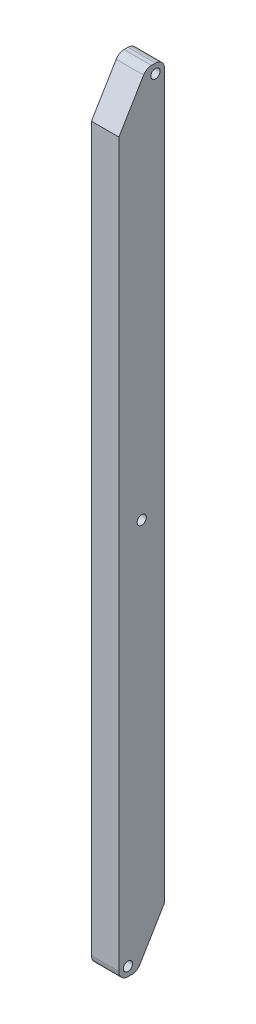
ISO-10303-21;
HEADER;
FILE_DESCRIPTION(('STEP AP214'),'2;1');
FILE_NAME('part.step','',(''),(''),'','','');
FILE_SCHEMA(('AUTOMOTIVE_DESIGN { 1 0 10303 214 1 1 1 1 }'));
ENDSEC;
DATA;
#1=APPLICATION_CONTEXT('core data for automotive mechanical design processes');
#2=APPLICATION_PROTOCOL_DEFINITION('international standard','automotive_design',2000,#1);
#3=PRODUCT_CONTEXT('',#1,'mechanical');
#4=PRODUCT('Part','Part','',(#3));
#5=PRODUCT_RELATED_PRODUCT_CATEGORY('part','',(#4));
#6=PRODUCT_DEFINITION_FORMATION('','',#4);
#7=PRODUCT_DEFINITION_CONTEXT('part definition',#1,'design');
#8=PRODUCT_DEFINITION('design','',#6,#7);
#9=PRODUCT_DEFINITION_SHAPE('','',#8);
#10=(LENGTH_UNIT() NAMED_UNIT(*) SI_UNIT(.MILLI.,.METRE.));
#11=(NAMED_UNIT(*) PLANE_ANGLE_UNIT() SI_UNIT($,.RADIAN.));
#12=(NAMED_UNIT(*) SI_UNIT($,.STERADIAN.) SOLID_ANGLE_UNIT());
#13=UNCERTAINTY_MEASURE_WITH_UNIT(LENGTH_MEASURE(1.E-05),#10,'distance_accuracy_value','');
#14=(GEOMETRIC_REPRESENTATION_CONTEXT(3) GLOBAL_UNCERTAINTY_ASSIGNED_CONTEXT((#13)) GLOBAL_UNIT_ASSIGNED_CONTEXT((#10,
#11,#12)) REPRESENTATION_CONTEXT('',''));
#15=CARTESIAN_POINT('',(0.,0.,0.));
#16=DIRECTION('',(0.,0.,1.));
#17=DIRECTION('',(1.,0.,0.));
#18=AXIS2_PLACEMENT_3D('',#15,#16,#17);
#19=CARTESIAN_POINT('',(620.,0.,50.));
#20=DIRECTION('',(1.,0.,0.));
#21=DIRECTION('',(0.,0.,-1.));
#22=AXIS2_PLACEMENT_3D('',#19,#20,#21);
#23=PLANE('',#22);
#24=CARTESIAN_POINT('',(620.,0.,0.));
#25=DIRECTION('',(1.,0.,0.));
#26=DIRECTION('',(0.,0.,-1.));
#27=AXIS2_PLACEMENT_3D('',#24,#25,#26);
#28=CIRCLE('',#27,10.);
#29=CARTESIAN_POINT('',(620.,0.,-10.));
#30=VERTEX_POINT('',#29);
#31=EDGE_CURVE('E180',#30,#30,#28,.T.);
#32=ORIENTED_EDGE('',*,*,#31,.F.);
#33=EDGE_LOOP('',(#32));
#34=FACE_BOUND('',#33,.T.);
#35=DIRECTION('',(0.,0.,1.));
#36=VECTOR('',#35,1.);
#37=CARTESIAN_POINT('',(620.,850.,-9.99999999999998));
#38=LINE('',#37,#36);
#39=CARTESIAN_POINT('',(620.,850.,-30.));
#40=VERTEX_POINT('',#39);
#41=CARTESIAN_POINT('',(620.,850.,-21.3238075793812));
#42=VERTEX_POINT('',#41);
#43=EDGE_CURVE('E147',#40,#42,#38,.T.);
#44=ORIENTED_EDGE('',*,*,#43,.T.);
#45=CARTESIAN_POINT('',(620.,830.,-21.3238075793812));
#46=DIRECTION('',(1.,0.,0.));
#47=DIRECTION('',(0.,0.,-1.));
#48=AXIS2_PLACEMENT_3D('',#45,#46,#47);
#49=CIRCLE('',#48,20.);
#50=CARTESIAN_POINT('',(620.,840.28991510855,-4.17394906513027));
#51=VERTEX_POINT('',#50);
#52=EDGE_CURVE('E170',#42,#51,#49,.T.);
#53=ORIENTED_EDGE('',*,*,#52,.T.);
#54=DIRECTION('',(0.,-0.857492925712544,0.514495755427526));
#55=VECTOR('',#54,1.);
#56=CARTESIAN_POINT('',(620.,750.,50.));
#57=LINE('',#56,#55);
#58=CARTESIAN_POINT('',(620.,750.,50.));
#59=VERTEX_POINT('',#58);
#60=EDGE_CURVE('E238',#51,#59,#57,.T.);
#61=ORIENTED_EDGE('',*,*,#60,.T.);
#62=DIRECTION('',(0.,-1.,0.));
#63=VECTOR('',#62,1.);
#64=CARTESIAN_POINT('',(620.,0.,50.));
#65=LINE('',#64,#63);
#66=CARTESIAN_POINT('',(620.,-830.,50.));
#67=VERTEX_POINT('',#66);
#68=EDGE_CURVE('E247',#59,#67,#65,.T.);
#69=ORIENTED_EDGE('',*,*,#68,.T.);
#70=CARTESIAN_POINT('',(620.,-830.,30.));
#71=DIRECTION('',(1.,0.,0.));
#72=DIRECTION('',(0.,0.,-1.));
#73=AXIS2_PLACEMENT_3D('',#70,#71,#72);
#74=CIRCLE('',#73,20.);
#75=CARTESIAN_POINT('',(620.,-850.,30.));
#76=VERTEX_POINT('',#75);
#77=EDGE_CURVE('E165',#67,#76,#74,.T.);
#78=ORIENTED_EDGE('',*,*,#77,.T.);
#79=DIRECTION('',(0.,0.,-1.));
#80=VECTOR('',#79,1.);
#81=CARTESIAN_POINT('',(620.,-850.,50.));
#82=LINE('',#81,#80);
#83=CARTESIAN_POINT('',(620.,-850.,21.3238075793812));
#84=VERTEX_POINT('',#83);
#85=EDGE_CURVE('E131',#76,#84,#82,.T.);
#86=ORIENTED_EDGE('',*,*,#85,.T.);
#87=CARTESIAN_POINT('',(620.,-830.,21.3238075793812));
#88=DIRECTION('',(1.,0.,0.));
#89=DIRECTION('',(0.,0.,-1.));
#90=AXIS2_PLACEMENT_3D('',#87,#88,#89);
#91=CIRCLE('',#90,20.);
#92=CARTESIAN_POINT('',(620.,-840.28991510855,4.17394906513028));
#93=VERTEX_POINT('',#92);
#94=EDGE_CURVE('E126',#84,#93,#91,.T.);
#95=ORIENTED_EDGE('',*,*,#94,.T.);
#96=DIRECTION('',(0.,0.857492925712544,-0.514495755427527));
#97=VECTOR('',#96,1.);
#98=CARTESIAN_POINT('',(620.,-850.,9.99999999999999));
#99=LINE('',#98,#97);
#100=CARTESIAN_POINT('',(620.,-750.,-50.));
#101=VERTEX_POINT('',#100);
#102=EDGE_CURVE('E118',#93,#101,#99,.T.);
#103=ORIENTED_EDGE('',*,*,#102,.T.);
#104=DIRECTION('',(0.,-1.,0.));
#105=VECTOR('',#104,1.);
#106=CARTESIAN_POINT('',(620.,0.,-50.));
#107=LINE('',#106,#105);
#108=CARTESIAN_POINT('',(620.,830.,-50.));
#109=VERTEX_POINT('',#108);
#110=EDGE_CURVE('E122',#109,#101,#107,.T.);
#111=ORIENTED_EDGE('',*,*,#110,.F.);
#112=CARTESIAN_POINT('',(620.,830.,-30.));
#113=DIRECTION('',(1.,0.,0.));
#114=DIRECTION('',(0.,0.,-1.));
#115=AXIS2_PLACEMENT_3D('',#112,#113,#114);
#116=CIRCLE('',#115,20.);
#117=EDGE_CURVE('E168',#109,#40,#116,.T.);
#118=ORIENTED_EDGE('',*,*,#117,.T.);
#119=EDGE_LOOP('',(#44,#53,#61,#69,#78,#86,#95,#103,#111,#118));
#120=FACE_BOUND('',#119,.T.);
#121=CARTESIAN_POINT('',(620.,830.,-30.));
#122=DIRECTION('',(1.,0.,0.));
#123=DIRECTION('',(0.,0.,-1.));
#124=AXIS2_PLACEMENT_3D('',#121,#122,#123);
#125=CIRCLE('',#124,10.);
#126=CARTESIAN_POINT('',(620.,830.,-20.));
#127=VERTEX_POINT('',#126);
#128=EDGE_CURVE('E231',#127,#127,#125,.T.);
#129=ORIENTED_EDGE('',*,*,#128,.F.);
#130=EDGE_LOOP('',(#129));
#131=FACE_BOUND('',#130,.T.);
#132=CARTESIAN_POINT('',(620.,-830.,30.));
#133=DIRECTION('',(1.,0.,0.));
#134=DIRECTION('',(0.,0.,-1.));
#135=AXIS2_PLACEMENT_3D('',#132,#133,#134);
#136=CIRCLE('',#135,10.);
#137=CARTESIAN_POINT('',(620.,-830.,40.));
#138=VERTEX_POINT('',#137);
#139=EDGE_CURVE('E186',#138,#138,#136,.T.);
#140=ORIENTED_EDGE('',*,*,#139,.F.);
#141=EDGE_LOOP('',(#140));
#142=FACE_BOUND('',#141,.T.);
#143=ADVANCED_FACE('F41',(#34,#120,#131,#142),#23,.T.);
#144=CARTESIAN_POINT('',(560.,0.,50.));
#145=DIRECTION('',(1.,0.,0.));
#146=DIRECTION('',(0.,0.,-1.));
#147=AXIS2_PLACEMENT_3D('',#144,#145,#146);
#148=PLANE('',#147);
#149=DIRECTION('',(0.,-0.857492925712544,0.514495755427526));
#150=VECTOR('',#149,1.);
#151=CARTESIAN_POINT('',(560.,750.,50.));
#152=LINE('',#151,#150);
#153=CARTESIAN_POINT('',(560.,840.28991510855,-4.17394906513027));
#154=VERTEX_POINT('',#153);
#155=CARTESIAN_POINT('',(560.,750.,50.));
#156=VERTEX_POINT('',#155);
#157=EDGE_CURVE('E234',#154,#156,#152,.T.);
#158=ORIENTED_EDGE('',*,*,#157,.F.);
#159=CARTESIAN_POINT('',(560.,830.,-21.3238075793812));
#160=DIRECTION('',(1.,0.,0.));
#161=DIRECTION('',(0.,0.,-1.));
#162=AXIS2_PLACEMENT_3D('',#159,#160,#161);
#163=CIRCLE('',#162,20.);
#164=CARTESIAN_POINT('',(560.,850.,-21.3238075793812));
#165=VERTEX_POINT('',#164);
#166=EDGE_CURVE('E158',#154,#165,#163,.F.);
#167=ORIENTED_EDGE('',*,*,#166,.T.);
#168=DIRECTION('',(0.,0.,1.));
#169=VECTOR('',#168,1.);
#170=CARTESIAN_POINT('',(560.,850.,-9.99999999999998));
#171=LINE('',#170,#169);
#172=CARTESIAN_POINT('',(560.,850.,-30.));
#173=VERTEX_POINT('',#172);
#174=EDGE_CURVE('E240',#173,#165,#171,.T.);
#175=ORIENTED_EDGE('',*,*,#174,.F.);
#176=CARTESIAN_POINT('',(560.,830.,-30.));
#177=DIRECTION('',(1.,0.,0.));
#178=DIRECTION('',(0.,0.,-1.));
#179=AXIS2_PLACEMENT_3D('',#176,#177,#178);
#180=CIRCLE('',#179,20.);
#181=CARTESIAN_POINT('',(560.,830.,-50.));
#182=VERTEX_POINT('',#181);
#183=EDGE_CURVE('E154',#173,#182,#180,.F.);
#184=ORIENTED_EDGE('',*,*,#183,.T.);
#185=DIRECTION('',(0.,-1.,0.));
#186=VECTOR('',#185,1.);
#187=CARTESIAN_POINT('',(560.,0.,-50.));
#188=LINE('',#187,#186);
#189=CARTESIAN_POINT('',(560.,-750.,-50.));
#190=VERTEX_POINT('',#189);
#191=EDGE_CURVE('E145',#182,#190,#188,.T.);
#192=ORIENTED_EDGE('',*,*,#191,.T.);
#193=DIRECTION('',(0.,0.857492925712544,-0.514495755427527));
#194=VECTOR('',#193,1.);
#195=CARTESIAN_POINT('',(560.,-850.,9.99999999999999));
#196=LINE('',#195,#194);
#197=CARTESIAN_POINT('',(560.,-840.28991510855,4.17394906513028));
#198=VERTEX_POINT('',#197);
#199=EDGE_CURVE('E143',#198,#190,#196,.T.);
#200=ORIENTED_EDGE('',*,*,#199,.F.);
#201=CARTESIAN_POINT('',(560.,-830.,21.3238075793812));
#202=DIRECTION('',(1.,0.,0.));
#203=DIRECTION('',(0.,0.,-1.));
#204=AXIS2_PLACEMENT_3D('',#201,#202,#203);
#205=CIRCLE('',#204,20.);
#206=CARTESIAN_POINT('',(560.,-850.,21.3238075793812));
#207=VERTEX_POINT('',#206);
#208=EDGE_CURVE('E64',#198,#207,#205,.F.);
#209=ORIENTED_EDGE('',*,*,#208,.T.);
#210=DIRECTION('',(0.,0.,-1.));
#211=VECTOR('',#210,1.);
#212=CARTESIAN_POINT('',(560.,-850.,50.));
#213=LINE('',#212,#211);
#214=CARTESIAN_POINT('',(560.,-850.,30.));
#215=VERTEX_POINT('',#214);
#216=EDGE_CURVE('E132',#215,#207,#213,.T.);
#217=ORIENTED_EDGE('',*,*,#216,.F.);
#218=CARTESIAN_POINT('',(560.,-830.,30.));
#219=DIRECTION('',(1.,0.,0.));
#220=DIRECTION('',(0.,0.,-1.));
#221=AXIS2_PLACEMENT_3D('',#218,#219,#220);
#222=CIRCLE('',#221,20.);
#223=CARTESIAN_POINT('',(560.,-830.,50.));
#224=VERTEX_POINT('',#223);
#225=EDGE_CURVE('E58',#215,#224,#222,.F.);
#226=ORIENTED_EDGE('',*,*,#225,.T.);
#227=DIRECTION('',(0.,-1.,0.));
#228=VECTOR('',#227,1.);
#229=CARTESIAN_POINT('',(560.,0.,50.));
#230=LINE('',#229,#228);
#231=EDGE_CURVE('E140',#156,#224,#230,.T.);
#232=ORIENTED_EDGE('',*,*,#231,.F.);
#233=EDGE_LOOP('',(#158,#167,#175,#184,#192,#200,#209,#217,#226,#232));
#234=FACE_BOUND('',#233,.T.);
#235=CARTESIAN_POINT('',(560.,830.,-30.));
#236=DIRECTION('',(1.,0.,0.));
#237=DIRECTION('',(0.,0.,-1.));
#238=AXIS2_PLACEMENT_3D('',#235,#236,#237);
#239=CIRCLE('',#238,10.);
#240=CARTESIAN_POINT('',(560.,830.,-20.));
#241=VERTEX_POINT('',#240);
#242=EDGE_CURVE('E235',#241,#241,#239,.T.);
#243=ORIENTED_EDGE('',*,*,#242,.T.);
#244=EDGE_LOOP('',(#243));
#245=FACE_BOUND('',#244,.T.);
#246=CARTESIAN_POINT('',(560.,-830.,30.));
#247=DIRECTION('',(1.,0.,0.));
#248=DIRECTION('',(0.,0.,-1.));
#249=AXIS2_PLACEMENT_3D('',#246,#247,#248);
#250=CIRCLE('',#249,10.);
#251=CARTESIAN_POINT('',(560.,-830.,40.));
#252=VERTEX_POINT('',#251);
#253=EDGE_CURVE('E182',#252,#252,#250,.T.);
#254=ORIENTED_EDGE('',*,*,#253,.T.);
#255=EDGE_LOOP('',(#254));
#256=FACE_BOUND('',#255,.T.);
#257=CARTESIAN_POINT('',(560.,0.,0.));
#258=DIRECTION('',(1.,0.,0.));
#259=DIRECTION('',(0.,0.,-1.));
#260=AXIS2_PLACEMENT_3D('',#257,#258,#259);
#261=CIRCLE('',#260,10.);
#262=CARTESIAN_POINT('',(560.,0.,-10.));
#263=VERTEX_POINT('',#262);
#264=EDGE_CURVE('E45',#263,#263,#261,.F.);
#265=ORIENTED_EDGE('',*,*,#264,.F.);
#266=EDGE_LOOP('',(#265));
#267=FACE_BOUND('',#266,.T.);
#268=ADVANCED_FACE('F193',(#234,#245,#256,#267),#148,.F.);
#269=CARTESIAN_POINT('',(0.,0.,50.));
#270=DIRECTION('',(0.,0.,1.));
#271=DIRECTION('',(1.,0.,0.));
#272=AXIS2_PLACEMENT_3D('',#269,#270,#271);
#273=PLANE('',#272);
#274=DIRECTION('',(1.,0.,0.));
#275=VECTOR('',#274,1.);
#276=CARTESIAN_POINT('',(0.,750.,50.));
#277=LINE('',#276,#275);
#278=EDGE_CURVE('E155',#156,#59,#277,.T.);
#279=ORIENTED_EDGE('',*,*,#278,.F.);
#280=ORIENTED_EDGE('',*,*,#231,.T.);
#281=DIRECTION('',(-1.,0.,0.));
#282=VECTOR('',#281,1.);
#283=CARTESIAN_POINT('',(620.,-830.,50.));
#284=LINE('',#283,#282);
#285=EDGE_CURVE('E11',#224,#67,#284,.F.);
#286=ORIENTED_EDGE('',*,*,#285,.T.);
#287=ORIENTED_EDGE('',*,*,#68,.F.);
#288=EDGE_LOOP('',(#279,#280,#286,#287));
#289=FACE_BOUND('',#288,.T.);
#290=ADVANCED_FACE('F195',(#289),#273,.T.);
#291=CARTESIAN_POINT('',(0.,0.,-50.));
#292=DIRECTION('',(0.,0.,1.));
#293=DIRECTION('',(1.,0.,0.));
#294=AXIS2_PLACEMENT_3D('',#291,#292,#293);
#295=PLANE('',#294);
#296=ORIENTED_EDGE('',*,*,#191,.F.);
#297=DIRECTION('',(-1.,0.,0.));
#298=VECTOR('',#297,1.);
#299=CARTESIAN_POINT('',(0.,830.,-50.));
#300=LINE('',#299,#298);
#301=EDGE_CURVE('E139',#182,#109,#300,.F.);
#302=ORIENTED_EDGE('',*,*,#301,.T.);
#303=ORIENTED_EDGE('',*,*,#110,.T.);
#304=DIRECTION('',(1.,0.,0.));
#305=VECTOR('',#304,1.);
#306=CARTESIAN_POINT('',(0.,-750.,-50.));
#307=LINE('',#306,#305);
#308=EDGE_CURVE('E137',#190,#101,#307,.T.);
#309=ORIENTED_EDGE('',*,*,#308,.F.);
#310=EDGE_LOOP('',(#296,#302,#303,#309));
#311=FACE_BOUND('',#310,.T.);
#312=ADVANCED_FACE('F136',(#311),#295,.F.);
#313=CARTESIAN_POINT('',(620.,850.,-9.99999999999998));
#314=DIRECTION('',(0.,-1.,0.));
#315=DIRECTION('',(0.,0.,-1.));
#316=AXIS2_PLACEMENT_3D('',#313,#314,#315);
#317=PLANE('',#316);
#318=ORIENTED_EDGE('',*,*,#174,.T.);
#319=DIRECTION('',(-1.,0.,0.));
#320=VECTOR('',#319,1.);
#321=CARTESIAN_POINT('',(620.,850.,-21.3238075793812));
#322=LINE('',#321,#320);
#323=EDGE_CURVE('E163',#165,#42,#322,.F.);
#324=ORIENTED_EDGE('',*,*,#323,.T.);
#325=ORIENTED_EDGE('',*,*,#43,.F.);
#326=DIRECTION('',(-1.,0.,0.));
#327=VECTOR('',#326,1.);
#328=CARTESIAN_POINT('',(620.,850.,-30.));
#329=LINE('',#328,#327);
#330=EDGE_CURVE('E160',#40,#173,#329,.T.);
#331=ORIENTED_EDGE('',*,*,#330,.T.);
#332=EDGE_LOOP('',(#318,#324,#325,#331));
#333=FACE_BOUND('',#332,.T.);
#334=ADVANCED_FACE('F275',(#333),#317,.F.);
#335=CARTESIAN_POINT('',(620.,750.,50.));
#336=DIRECTION('',(0.,-0.514495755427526,-0.857492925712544));
#337=DIRECTION('',(0.,0.857492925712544,-0.514495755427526));
#338=AXIS2_PLACEMENT_3D('',#335,#336,#337);
#339=PLANE('',#338);
#340=ORIENTED_EDGE('',*,*,#60,.F.);
#341=DIRECTION('',(-1.,0.,0.));
#342=VECTOR('',#341,1.);
#343=CARTESIAN_POINT('',(620.,840.28991510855,-4.17394906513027));
#344=LINE('',#343,#342);
#345=EDGE_CURVE('E151',#51,#154,#344,.T.);
#346=ORIENTED_EDGE('',*,*,#345,.T.);
#347=ORIENTED_EDGE('',*,*,#157,.T.);
#348=ORIENTED_EDGE('',*,*,#278,.T.);
#349=EDGE_LOOP('',(#340,#346,#347,#348));
#350=FACE_BOUND('',#349,.T.);
#351=ADVANCED_FACE('F254',(#350),#339,.F.);
#352=CARTESIAN_POINT('',(620.,830.,-30.));
#353=DIRECTION('',(-1.,0.,0.));
#354=DIRECTION('',(0.,0.,1.));
#355=AXIS2_PLACEMENT_3D('',#352,#353,#354);
#356=CYLINDRICAL_SURFACE('',#355,10.);
#357=CARTESIAN_POINT('',(620.,830.,-20.));
#358=CARTESIAN_POINT('',(619.375,830.,-20.));
#359=CARTESIAN_POINT('',(618.75,830.,-20.));
#360=CARTESIAN_POINT('',(617.5,830.,-20.));
#361=CARTESIAN_POINT('',(616.875,830.,-20.));
#362=CARTESIAN_POINT('',(615.625,830.,-20.));
#363=CARTESIAN_POINT('',(615.,830.,-20.));
#364=CARTESIAN_POINT('',(613.75,830.,-20.));
#365=CARTESIAN_POINT('',(613.125,830.,-20.));
#366=CARTESIAN_POINT('',(611.875,830.,-20.));
#367=CARTESIAN_POINT('',(611.25,830.,-20.));
#368=CARTESIAN_POINT('',(610.,830.,-20.));
#369=CARTESIAN_POINT('',(609.375,830.,-20.));
#370=CARTESIAN_POINT('',(608.125,830.,-20.));
#371=CARTESIAN_POINT('',(607.5,830.,-20.));
#372=CARTESIAN_POINT('',(606.25,830.,-20.));
#373=CARTESIAN_POINT('',(605.625,830.,-20.));
#374=CARTESIAN_POINT('',(604.375,830.,-20.));
#375=CARTESIAN_POINT('',(603.75,830.,-20.));
#376=CARTESIAN_POINT('',(602.5,830.,-20.));
#377=CARTESIAN_POINT('',(601.875,830.,-20.));
#378=CARTESIAN_POINT('',(600.625,830.,-20.));
#379=CARTESIAN_POINT('',(600.,830.,-20.));
#380=CARTESIAN_POINT('',(598.75,830.,-20.));
#381=CARTESIAN_POINT('',(598.125,830.,-20.));
#382=CARTESIAN_POINT('',(596.875,830.,-20.));
#383=CARTESIAN_POINT('',(596.25,830.,-20.));
#384=CARTESIAN_POINT('',(595.,830.,-20.));
#385=CARTESIAN_POINT('',(594.375,830.,-20.));
#386=CARTESIAN_POINT('',(593.125,830.,-20.));
#387=CARTESIAN_POINT('',(592.5,830.,-20.));
#388=CARTESIAN_POINT('',(591.25,830.,-20.));
#389=CARTESIAN_POINT('',(590.625,830.,-20.));
#390=CARTESIAN_POINT('',(589.375,830.,-20.));
#391=CARTESIAN_POINT('',(588.75,830.,-20.));
#392=CARTESIAN_POINT('',(587.5,830.,-20.));
#393=CARTESIAN_POINT('',(586.875,830.,-20.));
#394=CARTESIAN_POINT('',(585.625,830.,-20.));
#395=CARTESIAN_POINT('',(585.,830.,-20.));
#396=CARTESIAN_POINT('',(583.75,830.,-20.));
#397=CARTESIAN_POINT('',(583.125,830.,-20.));
#398=CARTESIAN_POINT('',(581.875,830.,-20.));
#399=CARTESIAN_POINT('',(581.25,830.,-20.));
#400=CARTESIAN_POINT('',(580.,830.,-20.));
#401=CARTESIAN_POINT('',(579.375,830.,-20.));
#402=CARTESIAN_POINT('',(578.125,830.,-20.));
#403=CARTESIAN_POINT('',(577.5,830.,-20.));
#404=CARTESIAN_POINT('',(576.25,830.,-20.));
#405=CARTESIAN_POINT('',(575.625,830.,-20.));
#406=CARTESIAN_POINT('',(574.375,830.,-20.));
#407=CARTESIAN_POINT('',(573.75,830.,-20.));
#408=CARTESIAN_POINT('',(572.5,830.,-20.));
#409=CARTESIAN_POINT('',(571.875,830.,-20.));
#410=CARTESIAN_POINT('',(570.625,830.,-20.));
#411=CARTESIAN_POINT('',(570.,830.,-20.));
#412=CARTESIAN_POINT('',(568.75,830.,-20.));
#413=CARTESIAN_POINT('',(568.125,830.,-20.));
#414=CARTESIAN_POINT('',(566.875,830.,-20.));
#415=CARTESIAN_POINT('',(566.25,830.,-20.));
#416=CARTESIAN_POINT('',(565.,830.,-20.));
#417=CARTESIAN_POINT('',(564.375,830.,-20.));
#418=CARTESIAN_POINT('',(563.125,830.,-20.));
#419=CARTESIAN_POINT('',(562.5,830.,-20.));
#420=CARTESIAN_POINT('',(561.25,830.,-20.));
#421=CARTESIAN_POINT('',(560.625,830.,-20.));
#422=CARTESIAN_POINT('',(560.,830.,-20.));
#423=B_SPLINE_CURVE_WITH_KNOTS('',3,(#357,#358,#359,#360,#361,#362,#363,#364,#365,#366,#367,
#368,#369,#370,#371,#372,#373,#374,#375,#376,#377,#378,#379,#380,#381,#382,#383,#384,#385,#386,
#387,#388,#389,#390,#391,#392,#393,#394,#395,#396,#397,#398,#399,#400,#401,#402,#403,#404,#405,
#406,#407,#408,#409,#410,#411,#412,#413,#414,#415,#416,#417,#418,#419,#420,#421,#422),
.UNSPECIFIED.,.F.,.F.,(4,2,2,2,2,2,2,2,2,2,2,2,2,2,2,2,2,2,2,2,2,2,2,2,2,2,2,2,2,2,2,2,4),(0.,
1.87500000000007,3.75000000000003,5.6250000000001,7.50000000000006,9.37500000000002,
11.2500000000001,13.1250000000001,15.,16.8750000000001,18.75,20.6250000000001,22.5000000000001,
24.375,26.2500000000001,28.1250000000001,30.,31.8750000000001,33.7500000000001,35.6250000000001,
37.5000000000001,39.375,41.2500000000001,43.1250000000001,45.,46.8750000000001,48.7500000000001,
50.6250000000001,52.5000000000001,54.3750000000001,56.2500000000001,58.1250000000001,
60.0000000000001),.UNSPECIFIED.);
#424=EDGE_CURVE('BSEAM263',#127,#241,#423,.T.);
#425=ORIENTED_EDGE('',*,*,#128,.T.);
#426=ORIENTED_EDGE('',*,*,#242,.F.);
#427=ORIENTED_EDGE('',*,*,#424,.T.);
#428=ORIENTED_EDGE('',*,*,#424,.F.);
#429=EDGE_LOOP('',(#425,#427,#426,#428));
#430=FACE_BOUND('',#429,.T.);
#431=ADVANCED_FACE('F263',(#430),#356,.F.);
#432=CARTESIAN_POINT('',(620.,-850.,50.));
#433=DIRECTION('',(0.,1.,0.));
#434=DIRECTION('',(0.,0.,1.));
#435=AXIS2_PLACEMENT_3D('',#432,#433,#434);
#436=PLANE('',#435);
#437=ORIENTED_EDGE('',*,*,#216,.T.);
#438=DIRECTION('',(-1.,0.,0.));
#439=VECTOR('',#438,1.);
#440=CARTESIAN_POINT('',(620.,-850.,21.3238075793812));
#441=LINE('',#440,#439);
#442=EDGE_CURVE('E50',#207,#84,#441,.F.);
#443=ORIENTED_EDGE('',*,*,#442,.T.);
#444=ORIENTED_EDGE('',*,*,#85,.F.);
#445=DIRECTION('',(-1.,0.,0.));
#446=VECTOR('',#445,1.);
#447=CARTESIAN_POINT('',(560.,-850.,30.));
#448=LINE('',#447,#446);
#449=EDGE_CURVE('E177',#76,#215,#448,.T.);
#450=ORIENTED_EDGE('',*,*,#449,.T.);
#451=EDGE_LOOP('',(#437,#443,#444,#450));
#452=FACE_BOUND('',#451,.T.);
#453=ADVANCED_FACE('F261',(#452),#436,.F.);
#454=CARTESIAN_POINT('',(620.,-850.,9.99999999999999));
#455=DIRECTION('',(0.,0.514495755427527,0.857492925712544));
#456=DIRECTION('',(0.,-0.857492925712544,0.514495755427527));
#457=AXIS2_PLACEMENT_3D('',#454,#455,#456);
#458=PLANE('',#457);
#459=ORIENTED_EDGE('',*,*,#102,.F.);
#460=DIRECTION('',(-1.,0.,0.));
#461=VECTOR('',#460,1.);
#462=CARTESIAN_POINT('',(620.,-840.28991510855,4.17394906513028));
#463=LINE('',#462,#461);
#464=EDGE_CURVE('E173',#93,#198,#463,.T.);
#465=ORIENTED_EDGE('',*,*,#464,.T.);
#466=ORIENTED_EDGE('',*,*,#199,.T.);
#467=ORIENTED_EDGE('',*,*,#308,.T.);
#468=EDGE_LOOP('',(#459,#465,#466,#467));
#469=FACE_BOUND('',#468,.T.);
#470=ADVANCED_FACE('F142',(#469),#458,.F.);
#471=CARTESIAN_POINT('',(620.,-830.,30.));
#472=DIRECTION('',(-1.,0.,0.));
#473=DIRECTION('',(0.,0.,1.));
#474=AXIS2_PLACEMENT_3D('',#471,#472,#473);
#475=CYLINDRICAL_SURFACE('',#474,10.);
#476=CARTESIAN_POINT('',(620.,-830.,40.));
#477=CARTESIAN_POINT('',(619.375,-830.,40.));
#478=CARTESIAN_POINT('',(618.75,-830.,40.));
#479=CARTESIAN_POINT('',(617.5,-830.,40.));
#480=CARTESIAN_POINT('',(616.875,-830.,40.));
#481=CARTESIAN_POINT('',(615.625,-830.,40.));
#482=CARTESIAN_POINT('',(615.,-830.,40.));
#483=CARTESIAN_POINT('',(613.75,-830.,40.));
#484=CARTESIAN_POINT('',(613.125,-830.,40.));
#485=CARTESIAN_POINT('',(611.875,-830.,40.));
#486=CARTESIAN_POINT('',(611.25,-830.,40.));
#487=CARTESIAN_POINT('',(610.,-830.,40.));
#488=CARTESIAN_POINT('',(609.375,-830.,40.));
#489=CARTESIAN_POINT('',(608.125,-830.,40.));
#490=CARTESIAN_POINT('',(607.5,-830.,40.));
#491=CARTESIAN_POINT('',(606.25,-830.,40.));
#492=CARTESIAN_POINT('',(605.625,-830.,40.));
#493=CARTESIAN_POINT('',(604.375,-830.,40.));
#494=CARTESIAN_POINT('',(603.75,-830.,40.));
#495=CARTESIAN_POINT('',(602.5,-830.,40.));
#496=CARTESIAN_POINT('',(601.875,-830.,40.));
#497=CARTESIAN_POINT('',(600.625,-830.,40.));
#498=CARTESIAN_POINT('',(600.,-830.,40.));
#499=CARTESIAN_POINT('',(598.75,-830.,40.));
#500=CARTESIAN_POINT('',(598.125,-830.,40.));
#501=CARTESIAN_POINT('',(596.875,-830.,40.));
#502=CARTESIAN_POINT('',(596.25,-830.,40.));
#503=CARTESIAN_POINT('',(595.,-830.,40.));
#504=CARTESIAN_POINT('',(594.375,-830.,40.));
#505=CARTESIAN_POINT('',(593.125,-830.,40.));
#506=CARTESIAN_POINT('',(592.5,-830.,40.));
#507=CARTESIAN_POINT('',(591.25,-830.,40.));
#508=CARTESIAN_POINT('',(590.625,-830.,40.));
#509=CARTESIAN_POINT('',(589.375,-830.,40.));
#510=CARTESIAN_POINT('',(588.75,-830.,40.));
#511=CARTESIAN_POINT('',(587.5,-830.,40.));
#512=CARTESIAN_POINT('',(586.875,-830.,40.));
#513=CARTESIAN_POINT('',(585.625,-830.,40.));
#514=CARTESIAN_POINT('',(585.,-830.,40.));
#515=CARTESIAN_POINT('',(583.75,-830.,40.));
#516=CARTESIAN_POINT('',(583.125,-830.,40.));
#517=CARTESIAN_POINT('',(581.875,-830.,40.));
#518=CARTESIAN_POINT('',(581.25,-830.,40.));
#519=CARTESIAN_POINT('',(580.,-830.,40.));
#520=CARTESIAN_POINT('',(579.375,-830.,40.));
#521=CARTESIAN_POINT('',(578.125,-830.,40.));
#522=CARTESIAN_POINT('',(577.5,-830.,40.));
#523=CARTESIAN_POINT('',(576.25,-830.,40.));
#524=CARTESIAN_POINT('',(575.625,-830.,40.));
#525=CARTESIAN_POINT('',(574.375,-830.,40.));
#526=CARTESIAN_POINT('',(573.75,-830.,40.));
#527=CARTESIAN_POINT('',(572.5,-830.,40.));
#528=CARTESIAN_POINT('',(571.875,-830.,40.));
#529=CARTESIAN_POINT('',(570.625,-830.,40.));
#530=CARTESIAN_POINT('',(570.,-830.,40.));
#531=CARTESIAN_POINT('',(568.75,-830.,40.));
#532=CARTESIAN_POINT('',(568.125,-830.,40.));
#533=CARTESIAN_POINT('',(566.875,-830.,40.));
#534=CARTESIAN_POINT('',(566.25,-830.,40.));
#535=CARTESIAN_POINT('',(565.,-830.,40.));
#536=CARTESIAN_POINT('',(564.375,-830.,40.));
#537=CARTESIAN_POINT('',(563.125,-830.,40.));
#538=CARTESIAN_POINT('',(562.5,-830.,40.));
#539=CARTESIAN_POINT('',(561.25,-830.,40.));
#540=CARTESIAN_POINT('',(560.625,-830.,40.));
#541=CARTESIAN_POINT('',(560.,-830.,40.));
#542=B_SPLINE_CURVE_WITH_KNOTS('',3,(#476,#477,#478,#479,#480,#481,#482,#483,#484,#485,#486,
#487,#488,#489,#490,#491,#492,#493,#494,#495,#496,#497,#498,#499,#500,#501,#502,#503,#504,#505,
#506,#507,#508,#509,#510,#511,#512,#513,#514,#515,#516,#517,#518,#519,#520,#521,#522,#523,#524,
#525,#526,#527,#528,#529,#530,#531,#532,#533,#534,#535,#536,#537,#538,#539,#540,#541),
.UNSPECIFIED.,.F.,.F.,(4,2,2,2,2,2,2,2,2,2,2,2,2,2,2,2,2,2,2,2,2,2,2,2,2,2,2,2,2,2,2,2,4),(0.,
1.87500000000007,3.75000000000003,5.6250000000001,7.50000000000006,9.37500000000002,
11.2500000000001,13.1250000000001,15.,16.8750000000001,18.75,20.6250000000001,22.5000000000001,
24.375,26.2500000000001,28.1250000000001,30.,31.8750000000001,33.7500000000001,35.6250000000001,
37.5000000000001,39.375,41.2500000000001,43.1250000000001,45.,46.8750000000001,48.7500000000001,
50.6250000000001,52.5000000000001,54.3750000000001,56.2500000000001,58.1250000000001,
60.0000000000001),.UNSPECIFIED.);
#543=EDGE_CURVE('BSEAM213',#138,#252,#542,.T.);
#544=ORIENTED_EDGE('',*,*,#139,.T.);
#545=ORIENTED_EDGE('',*,*,#253,.F.);
#546=ORIENTED_EDGE('',*,*,#543,.T.);
#547=ORIENTED_EDGE('',*,*,#543,.F.);
#548=EDGE_LOOP('',(#544,#546,#545,#547));
#549=FACE_BOUND('',#548,.T.);
#550=ADVANCED_FACE('F213',(#549),#475,.F.);
#551=CARTESIAN_POINT('',(620.,830.,-21.3238075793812));
#552=DIRECTION('',(-1.,0.,0.));
#553=DIRECTION('',(0.,0.,1.));
#554=AXIS2_PLACEMENT_3D('',#551,#552,#553);
#555=CYLINDRICAL_SURFACE('',#554,20.);
#556=ORIENTED_EDGE('',*,*,#52,.F.);
#557=ORIENTED_EDGE('',*,*,#323,.F.);
#558=ORIENTED_EDGE('',*,*,#166,.F.);
#559=ORIENTED_EDGE('',*,*,#345,.F.);
#560=EDGE_LOOP('',(#556,#557,#558,#559));
#561=FACE_BOUND('',#560,.T.);
#562=ADVANCED_FACE('F209',(#561),#555,.T.);
#563=CARTESIAN_POINT('',(620.,830.,-30.));
#564=DIRECTION('',(-1.,0.,0.));
#565=DIRECTION('',(0.,0.,1.));
#566=AXIS2_PLACEMENT_3D('',#563,#564,#565);
#567=CYLINDRICAL_SURFACE('',#566,20.);
#568=ORIENTED_EDGE('',*,*,#117,.F.);
#569=ORIENTED_EDGE('',*,*,#301,.F.);
#570=ORIENTED_EDGE('',*,*,#183,.F.);
#571=ORIENTED_EDGE('',*,*,#330,.F.);
#572=EDGE_LOOP('',(#568,#569,#570,#571));
#573=FACE_BOUND('',#572,.T.);
#574=ADVANCED_FACE('F212',(#573),#567,.T.);
#575=CARTESIAN_POINT('',(620.,-830.,21.3238075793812));
#576=DIRECTION('',(-1.,0.,0.));
#577=DIRECTION('',(0.,0.,1.));
#578=AXIS2_PLACEMENT_3D('',#575,#576,#577);
#579=CYLINDRICAL_SURFACE('',#578,20.);
#580=ORIENTED_EDGE('',*,*,#94,.F.);
#581=ORIENTED_EDGE('',*,*,#442,.F.);
#582=ORIENTED_EDGE('',*,*,#208,.F.);
#583=ORIENTED_EDGE('',*,*,#464,.F.);
#584=EDGE_LOOP('',(#580,#581,#582,#583));
#585=FACE_BOUND('',#584,.T.);
#586=ADVANCED_FACE('F216',(#585),#579,.T.);
#587=CARTESIAN_POINT('',(620.,-830.,30.));
#588=DIRECTION('',(1.,0.,0.));
#589=DIRECTION('',(0.,0.,-1.));
#590=AXIS2_PLACEMENT_3D('',#587,#588,#589);
#591=CYLINDRICAL_SURFACE('',#590,20.);
#592=ORIENTED_EDGE('',*,*,#77,.F.);
#593=ORIENTED_EDGE('',*,*,#285,.F.);
#594=ORIENTED_EDGE('',*,*,#225,.F.);
#595=ORIENTED_EDGE('',*,*,#449,.F.);
#596=EDGE_LOOP('',(#592,#593,#594,#595));
#597=FACE_BOUND('',#596,.T.);
#598=ADVANCED_FACE('F43',(#597),#591,.T.);
#599=CARTESIAN_POINT('',(-750.,0.,0.));
#600=DIRECTION('',(1.,0.,0.));
#601=DIRECTION('',(0.,0.,-1.));
#602=AXIS2_PLACEMENT_3D('',#599,#600,#601);
#603=CYLINDRICAL_SURFACE('',#602,10.);
#604=ORIENTED_EDGE('',*,*,#264,.T.);
#605=EDGE_LOOP('',(#604));
#606=FACE_BOUND('',#605,.T.);
#607=ORIENTED_EDGE('',*,*,#31,.T.);
#608=EDGE_LOOP('',(#607));
#609=FACE_BOUND('',#608,.T.);
#610=ADVANCED_FACE('F191',(#606,#609),#603,.F.);
#611=CLOSED_SHELL('',(#143,#268,#290,#312,#334,#351,#431,#453,#470,#550,#562,#574,#586,#598,#610));
#612=MANIFOLD_SOLID_BREP('B2',#611);
#613=ADVANCED_BREP_SHAPE_REPRESENTATION('',(#18,#612),#14);
#614=SHAPE_DEFINITION_REPRESENTATION(#9,#613);
ENDSEC;
END-ISO-10303-21;
